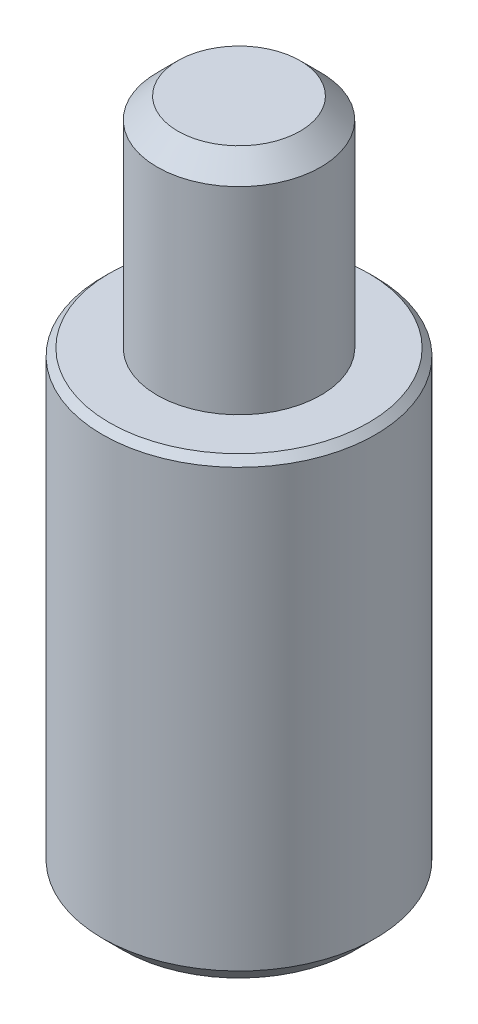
from build123d import *

# Parameters (mm, degrees)
SKETCH1_R      = 5
EXTRUDE1_DEPTH = 17
SKETCH2_R      = 3
EXTRUDE2_DEPTH = 8
CHAMFER1_SIZE  = 0.254
EXTRUDE3_DEPTH = 5
CHAMFER2_SIZE  = 0.762
CHAMFER3_SIZE  = 0.76


with BuildPart() as part:
    # Sketch1 → Extrude1 (new body)
    with BuildSketch(Plane(origin=(0, 0, 0), x_dir=(1, 0, 0), z_dir=(0, 1, 0))):
        with Locations(Location((0, 0, 0), (0, 0, 270))):
            Circle(SKETCH1_R)
    extrude(amount=EXTRUDE1_DEPTH)

    # Sketch2 → Extrude2 (add)
    with BuildSketch(Plane(origin=(0, 17, 0), x_dir=(1, 0, 0), z_dir=(0, 1, 0))):
        with Locations(Location((0, 0, 0), (0, 0, 270))):
            Circle(SKETCH2_R)
    extrude(amount=EXTRUDE2_DEPTH)

    # Chamfer1
    chamfer1_edges = [part.edges().sort_by_distance(p)[0] for p in [
        (0, 17, -5),
    ]]
    chamfer(chamfer1_edges, length=CHAMFER1_SIZE)

    # Sketch3 → Extrude3 (cut)
    with BuildSketch(Plane.XZ):
        Polygon((1.443375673, 2.5), (-1.443375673, 2.5), (-2.886751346, 0), (-1.443375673, -2.5), (1.443375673, -2.5), (2.886751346, 0), align=None)
    extrude(amount=-EXTRUDE3_DEPTH, mode=Mode.SUBTRACT)

    # Chamfer2
    chamfer2_edges = [part.edges().sort_by_distance(p)[0] for p in [
        (0, 0, -5),
    ]]
    chamfer(chamfer2_edges, length=CHAMFER2_SIZE)

    # Chamfer3
    chamfer3_edges = [part.edges().sort_by_distance(p)[0] for p in [
        (0, 25, -3),
    ]]
    chamfer(chamfer3_edges, length=CHAMFER3_SIZE)


solid = part.part
